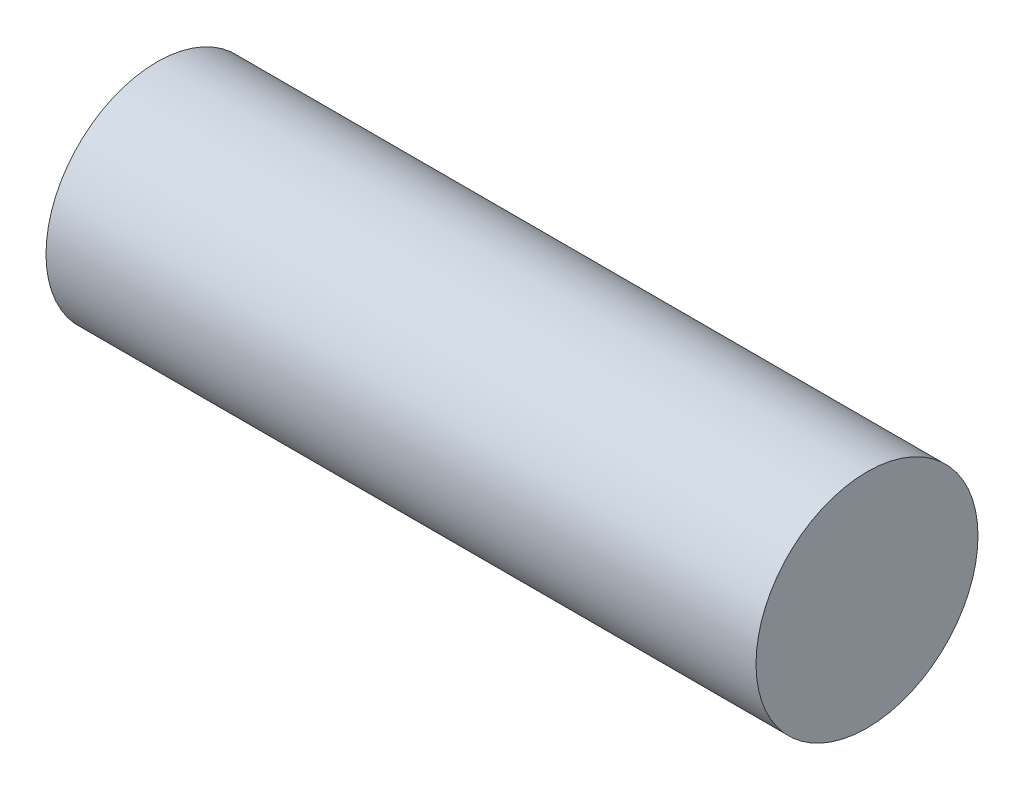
ISO-10303-21;
HEADER;
FILE_DESCRIPTION(('STEP AP214'),'2;1');
FILE_NAME('part.step','',(''),(''),'','','');
FILE_SCHEMA(('AUTOMOTIVE_DESIGN { 1 0 10303 214 1 1 1 1 }'));
ENDSEC;
DATA;
#1=APPLICATION_CONTEXT('core data for automotive mechanical design processes');
#2=APPLICATION_PROTOCOL_DEFINITION('international standard','automotive_design',2000,#1);
#3=PRODUCT_CONTEXT('',#1,'mechanical');
#4=PRODUCT('Part','Part','',(#3));
#5=PRODUCT_RELATED_PRODUCT_CATEGORY('part','',(#4));
#6=PRODUCT_DEFINITION_FORMATION('','',#4);
#7=PRODUCT_DEFINITION_CONTEXT('part definition',#1,'design');
#8=PRODUCT_DEFINITION('design','',#6,#7);
#9=PRODUCT_DEFINITION_SHAPE('','',#8);
#10=(LENGTH_UNIT() NAMED_UNIT(*) SI_UNIT(.MILLI.,.METRE.));
#11=(NAMED_UNIT(*) PLANE_ANGLE_UNIT() SI_UNIT($,.RADIAN.));
#12=(NAMED_UNIT(*) SI_UNIT($,.STERADIAN.) SOLID_ANGLE_UNIT());
#13=UNCERTAINTY_MEASURE_WITH_UNIT(LENGTH_MEASURE(1.E-05),#10,'distance_accuracy_value','');
#14=(GEOMETRIC_REPRESENTATION_CONTEXT(3) GLOBAL_UNCERTAINTY_ASSIGNED_CONTEXT((#13)) GLOBAL_UNIT_ASSIGNED_CONTEXT((#10,
#11,#12)) REPRESENTATION_CONTEXT('',''));
#15=CARTESIAN_POINT('',(0.,0.,0.));
#16=DIRECTION('',(0.,0.,1.));
#17=DIRECTION('',(1.,0.,0.));
#18=AXIS2_PLACEMENT_3D('',#15,#16,#17);
#19=CARTESIAN_POINT('',(19.19,0.,0.));
#20=DIRECTION('',(-1.,0.,0.));
#21=DIRECTION('',(0.,0.,1.));
#22=AXIS2_PLACEMENT_3D('',#19,#20,#21);
#23=CYLINDRICAL_SURFACE('',#22,3.);
#24=CARTESIAN_POINT('',(19.19,0.,0.));
#25=DIRECTION('',(1.,0.,0.));
#26=DIRECTION('',(0.,0.,-1.));
#27=AXIS2_PLACEMENT_3D('',#24,#25,#26);
#28=CIRCLE('',#27,3.);
#29=CARTESIAN_POINT('',(19.19,0.,-3.));
#30=VERTEX_POINT('',#29);
#31=EDGE_CURVE('E10',#30,#30,#28,.T.);
#32=ORIENTED_EDGE('',*,*,#31,.F.);
#33=EDGE_LOOP('',(#32));
#34=FACE_BOUND('',#33,.T.);
#35=CARTESIAN_POINT('',(0.,0.,0.));
#36=DIRECTION('',(1.,0.,0.));
#37=DIRECTION('',(0.,0.,-1.));
#38=AXIS2_PLACEMENT_3D('',#35,#36,#37);
#39=CIRCLE('',#38,3.);
#40=CARTESIAN_POINT('',(0.,0.,-3.));
#41=VERTEX_POINT('',#40);
#42=EDGE_CURVE('E46',#41,#41,#39,.T.);
#43=ORIENTED_EDGE('',*,*,#42,.T.);
#44=EDGE_LOOP('',(#43));
#45=FACE_BOUND('',#44,.T.);
#46=ADVANCED_FACE('F43',(#34,#45),#23,.T.);
#47=CARTESIAN_POINT('',(19.19,0.,0.));
#48=DIRECTION('',(1.,0.,0.));
#49=DIRECTION('',(0.,0.,-1.));
#50=AXIS2_PLACEMENT_3D('',#47,#48,#49);
#51=PLANE('',#50);
#52=ORIENTED_EDGE('',*,*,#31,.T.);
#53=EDGE_LOOP('',(#52));
#54=FACE_BOUND('',#53,.T.);
#55=ADVANCED_FACE('F60',(#54),#51,.T.);
#56=CARTESIAN_POINT('',(0.,0.,0.));
#57=DIRECTION('',(1.,0.,0.));
#58=DIRECTION('',(0.,0.,-1.));
#59=AXIS2_PLACEMENT_3D('',#56,#57,#58);
#60=PLANE('',#59);
#61=ORIENTED_EDGE('',*,*,#42,.F.);
#62=EDGE_LOOP('',(#61));
#63=FACE_BOUND('',#62,.T.);
#64=ADVANCED_FACE('F58',(#63),#60,.F.);
#65=CLOSED_SHELL('',(#46,#55,#64));
#66=MANIFOLD_SOLID_BREP('B2',#65);
#67=ADVANCED_BREP_SHAPE_REPRESENTATION('',(#18,#66),#14);
#68=SHAPE_DEFINITION_REPRESENTATION(#9,#67);
ENDSEC;
END-ISO-10303-21;
